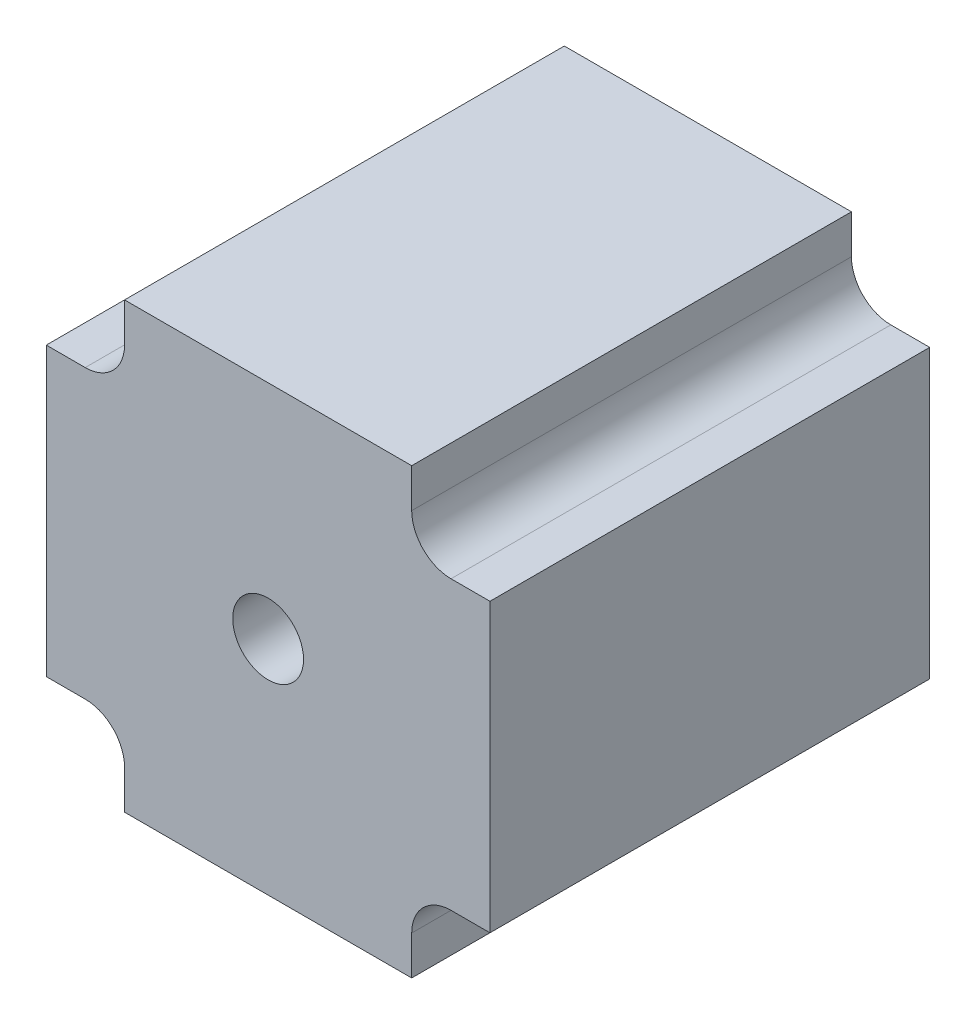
ISO-10303-21;
HEADER;
FILE_DESCRIPTION(('STEP AP214'),'2;1');
FILE_NAME('part.step','',(''),(''),'','','');
FILE_SCHEMA(('AUTOMOTIVE_DESIGN { 1 0 10303 214 1 1 1 1 }'));
ENDSEC;
DATA;
#1=APPLICATION_CONTEXT('core data for automotive mechanical design processes');
#2=APPLICATION_PROTOCOL_DEFINITION('international standard','automotive_design',2000,#1);
#3=PRODUCT_CONTEXT('',#1,'mechanical');
#4=PRODUCT('Part','Part','',(#3));
#5=PRODUCT_RELATED_PRODUCT_CATEGORY('part','',(#4));
#6=PRODUCT_DEFINITION_FORMATION('','',#4);
#7=PRODUCT_DEFINITION_CONTEXT('part definition',#1,'design');
#8=PRODUCT_DEFINITION('design','',#6,#7);
#9=PRODUCT_DEFINITION_SHAPE('','',#8);
#10=(LENGTH_UNIT() NAMED_UNIT(*) SI_UNIT(.MILLI.,.METRE.));
#11=(NAMED_UNIT(*) PLANE_ANGLE_UNIT() SI_UNIT($,.RADIAN.));
#12=(NAMED_UNIT(*) SI_UNIT($,.STERADIAN.) SOLID_ANGLE_UNIT());
#13=UNCERTAINTY_MEASURE_WITH_UNIT(LENGTH_MEASURE(1.E-05),#10,'distance_accuracy_value','');
#14=(GEOMETRIC_REPRESENTATION_CONTEXT(3) GLOBAL_UNCERTAINTY_ASSIGNED_CONTEXT((#13)) GLOBAL_UNIT_ASSIGNED_CONTEXT((#10,
#11,#12)) REPRESENTATION_CONTEXT('',''));
#15=CARTESIAN_POINT('',(0.,0.,0.));
#16=DIRECTION('',(0.,0.,1.));
#17=DIRECTION('',(1.,0.,0.));
#18=AXIS2_PLACEMENT_3D('',#15,#16,#17);
#19=CARTESIAN_POINT('',(-18.25,18.25,55.9));
#20=DIRECTION('',(0.,-1.,0.));
#21=DIRECTION('',(1.,0.,0.));
#22=AXIS2_PLACEMENT_3D('',#19,#20,#21);
#23=PLANE('',#22);
#24=DIRECTION('',(-1.,0.,0.));
#25=VECTOR('',#24,1.);
#26=CARTESIAN_POINT('',(-18.25,18.25,55.9));
#27=LINE('',#26,#25);
#28=CARTESIAN_POINT('',(-23.25,18.25,55.9));
#29=VERTEX_POINT('',#28);
#30=CARTESIAN_POINT('',(-28.2,18.25,55.9));
#31=VERTEX_POINT('',#30);
#32=EDGE_CURVE('E145',#29,#31,#27,.T.);
#33=ORIENTED_EDGE('',*,*,#32,.F.);
#34=DIRECTION('',(0.,0.,-1.));
#35=VECTOR('',#34,1.);
#36=CARTESIAN_POINT('',(-23.25,18.25,0.));
#37=LINE('',#36,#35);
#38=CARTESIAN_POINT('',(-23.25,18.25,0.));
#39=VERTEX_POINT('',#38);
#40=EDGE_CURVE('E189',#29,#39,#37,.T.);
#41=ORIENTED_EDGE('',*,*,#40,.T.);
#42=DIRECTION('',(-1.,0.,0.));
#43=VECTOR('',#42,1.);
#44=CARTESIAN_POINT('',(-18.25,18.25,0.));
#45=LINE('',#44,#43);
#46=CARTESIAN_POINT('',(-28.2,18.25,0.));
#47=VERTEX_POINT('',#46);
#48=EDGE_CURVE('E167',#39,#47,#45,.T.);
#49=ORIENTED_EDGE('',*,*,#48,.T.);
#50=DIRECTION('',(0.,0.,-1.));
#51=VECTOR('',#50,1.);
#52=CARTESIAN_POINT('',(-28.2,18.25,55.9));
#53=LINE('',#52,#51);
#54=EDGE_CURVE('E161',#31,#47,#53,.T.);
#55=ORIENTED_EDGE('',*,*,#54,.F.);
#56=EDGE_LOOP('',(#33,#41,#49,#55));
#57=FACE_BOUND('',#56,.T.);
#58=ADVANCED_FACE('F33',(#57),#23,.F.);
#59=CARTESIAN_POINT('',(-28.2,-18.25,55.9));
#60=DIRECTION('',(1.,0.,0.));
#61=DIRECTION('',(0.,0.,-1.));
#62=AXIS2_PLACEMENT_3D('',#59,#60,#61);
#63=PLANE('',#62);
#64=DIRECTION('',(0.,-1.,0.));
#65=VECTOR('',#64,1.);
#66=CARTESIAN_POINT('',(-28.2,-18.25,0.));
#67=LINE('',#66,#65);
#68=CARTESIAN_POINT('',(-28.2,-18.25,0.));
#69=VERTEX_POINT('',#68);
#70=EDGE_CURVE('E296',#47,#69,#67,.T.);
#71=ORIENTED_EDGE('',*,*,#70,.T.);
#72=DIRECTION('',(0.,0.,-1.));
#73=VECTOR('',#72,1.);
#74=CARTESIAN_POINT('',(-28.2,-18.25,55.9));
#75=LINE('',#74,#73);
#76=CARTESIAN_POINT('',(-28.2,-18.25,55.9));
#77=VERTEX_POINT('',#76);
#78=EDGE_CURVE('E163',#77,#69,#75,.T.);
#79=ORIENTED_EDGE('',*,*,#78,.F.);
#80=DIRECTION('',(0.,-1.,0.));
#81=VECTOR('',#80,1.);
#82=CARTESIAN_POINT('',(-28.2,-18.25,55.9));
#83=LINE('',#82,#81);
#84=EDGE_CURVE('E149',#31,#77,#83,.T.);
#85=ORIENTED_EDGE('',*,*,#84,.F.);
#86=ORIENTED_EDGE('',*,*,#54,.T.);
#87=EDGE_LOOP('',(#71,#79,#85,#86));
#88=FACE_BOUND('',#87,.T.);
#89=ADVANCED_FACE('F160',(#88),#63,.F.);
#90=CARTESIAN_POINT('',(-18.25,-18.25,55.9));
#91=DIRECTION('',(0.,1.,0.));
#92=DIRECTION('',(0.,0.,1.));
#93=AXIS2_PLACEMENT_3D('',#90,#91,#92);
#94=PLANE('',#93);
#95=DIRECTION('',(1.,0.,0.));
#96=VECTOR('',#95,1.);
#97=CARTESIAN_POINT('',(-18.25,-18.25,0.));
#98=LINE('',#97,#96);
#99=CARTESIAN_POINT('',(-23.25,-18.25,0.));
#100=VERTEX_POINT('',#99);
#101=EDGE_CURVE('E273',#69,#100,#98,.T.);
#102=ORIENTED_EDGE('',*,*,#101,.T.);
#103=DIRECTION('',(0.,0.,-1.));
#104=VECTOR('',#103,1.);
#105=CARTESIAN_POINT('',(-23.25,-18.25,55.9));
#106=LINE('',#105,#104);
#107=CARTESIAN_POINT('',(-23.25,-18.25,55.9));
#108=VERTEX_POINT('',#107);
#109=EDGE_CURVE('E172',#100,#108,#106,.F.);
#110=ORIENTED_EDGE('',*,*,#109,.T.);
#111=DIRECTION('',(1.,0.,0.));
#112=VECTOR('',#111,1.);
#113=CARTESIAN_POINT('',(-18.25,-18.25,55.9));
#114=LINE('',#113,#112);
#115=EDGE_CURVE('E165',#77,#108,#114,.T.);
#116=ORIENTED_EDGE('',*,*,#115,.F.);
#117=ORIENTED_EDGE('',*,*,#78,.T.);
#118=EDGE_LOOP('',(#102,#110,#116,#117));
#119=FACE_BOUND('',#118,.T.);
#120=ADVANCED_FACE('F302',(#119),#94,.F.);
#121=CARTESIAN_POINT('',(-18.25,-28.2,55.9));
#122=DIRECTION('',(1.,0.,0.));
#123=DIRECTION('',(0.,0.,-1.));
#124=AXIS2_PLACEMENT_3D('',#121,#122,#123);
#125=PLANE('',#124);
#126=DIRECTION('',(0.,-1.,0.));
#127=VECTOR('',#126,1.);
#128=CARTESIAN_POINT('',(-18.25,-28.2,55.9));
#129=LINE('',#128,#127);
#130=CARTESIAN_POINT('',(-18.25,-23.25,55.9));
#131=VERTEX_POINT('',#130);
#132=CARTESIAN_POINT('',(-18.25,-28.2,55.9));
#133=VERTEX_POINT('',#132);
#134=EDGE_CURVE('E307',#131,#133,#129,.T.);
#135=ORIENTED_EDGE('',*,*,#134,.F.);
#136=DIRECTION('',(0.,0.,-1.));
#137=VECTOR('',#136,1.);
#138=CARTESIAN_POINT('',(-18.25,-23.25,0.));
#139=LINE('',#138,#137);
#140=CARTESIAN_POINT('',(-18.25,-23.25,0.));
#141=VERTEX_POINT('',#140);
#142=EDGE_CURVE('E169',#131,#141,#139,.T.);
#143=ORIENTED_EDGE('',*,*,#142,.T.);
#144=DIRECTION('',(0.,-1.,0.));
#145=VECTOR('',#144,1.);
#146=CARTESIAN_POINT('',(-18.25,-28.2,0.));
#147=LINE('',#146,#145);
#148=CARTESIAN_POINT('',(-18.25,-28.2,0.));
#149=VERTEX_POINT('',#148);
#150=EDGE_CURVE('E268',#141,#149,#147,.T.);
#151=ORIENTED_EDGE('',*,*,#150,.T.);
#152=DIRECTION('',(0.,0.,-1.));
#153=VECTOR('',#152,1.);
#154=CARTESIAN_POINT('',(-18.25,-28.2,55.9));
#155=LINE('',#154,#153);
#156=EDGE_CURVE('E174',#133,#149,#155,.T.);
#157=ORIENTED_EDGE('',*,*,#156,.F.);
#158=EDGE_LOOP('',(#135,#143,#151,#157));
#159=FACE_BOUND('',#158,.T.);
#160=ADVANCED_FACE('F308',(#159),#125,.F.);
#161=CARTESIAN_POINT('',(18.25,-28.2,55.9));
#162=DIRECTION('',(0.,1.,0.));
#163=DIRECTION('',(0.,0.,1.));
#164=AXIS2_PLACEMENT_3D('',#161,#162,#163);
#165=PLANE('',#164);
#166=DIRECTION('',(1.,0.,0.));
#167=VECTOR('',#166,1.);
#168=CARTESIAN_POINT('',(18.25,-28.2,0.));
#169=LINE('',#168,#167);
#170=CARTESIAN_POINT('',(18.25,-28.2,0.));
#171=VERTEX_POINT('',#170);
#172=EDGE_CURVE('E262',#149,#171,#169,.T.);
#173=ORIENTED_EDGE('',*,*,#172,.T.);
#174=DIRECTION('',(0.,0.,-1.));
#175=VECTOR('',#174,1.);
#176=CARTESIAN_POINT('',(18.25,-28.2,55.9));
#177=LINE('',#176,#175);
#178=CARTESIAN_POINT('',(18.25,-28.2,55.9));
#179=VERTEX_POINT('',#178);
#180=EDGE_CURVE('E253',#179,#171,#177,.T.);
#181=ORIENTED_EDGE('',*,*,#180,.F.);
#182=DIRECTION('',(1.,0.,0.));
#183=VECTOR('',#182,1.);
#184=CARTESIAN_POINT('',(18.25,-28.2,55.9));
#185=LINE('',#184,#183);
#186=EDGE_CURVE('E263',#133,#179,#185,.T.);
#187=ORIENTED_EDGE('',*,*,#186,.F.);
#188=ORIENTED_EDGE('',*,*,#156,.T.);
#189=EDGE_LOOP('',(#173,#181,#187,#188));
#190=FACE_BOUND('',#189,.T.);
#191=ADVANCED_FACE('F260',(#190),#165,.F.);
#192=CARTESIAN_POINT('',(18.25,-28.2,55.9));
#193=DIRECTION('',(-1.,0.,0.));
#194=DIRECTION('',(0.,-1.,0.));
#195=AXIS2_PLACEMENT_3D('',#192,#193,#194);
#196=PLANE('',#195);
#197=DIRECTION('',(0.,1.,0.));
#198=VECTOR('',#197,1.);
#199=CARTESIAN_POINT('',(18.25,-28.2,0.));
#200=LINE('',#199,#198);
#201=CARTESIAN_POINT('',(18.25,-23.25,0.));
#202=VERTEX_POINT('',#201);
#203=EDGE_CURVE('E270',#171,#202,#200,.T.);
#204=ORIENTED_EDGE('',*,*,#203,.T.);
#205=DIRECTION('',(0.,0.,-1.));
#206=VECTOR('',#205,1.);
#207=CARTESIAN_POINT('',(18.25,-23.25,55.9));
#208=LINE('',#207,#206);
#209=CARTESIAN_POINT('',(18.25,-23.25,55.9));
#210=VERTEX_POINT('',#209);
#211=EDGE_CURVE('E182',#202,#210,#208,.F.);
#212=ORIENTED_EDGE('',*,*,#211,.T.);
#213=DIRECTION('',(0.,1.,0.));
#214=VECTOR('',#213,1.);
#215=CARTESIAN_POINT('',(18.25,-28.2,55.9));
#216=LINE('',#215,#214);
#217=EDGE_CURVE('E289',#179,#210,#216,.T.);
#218=ORIENTED_EDGE('',*,*,#217,.F.);
#219=ORIENTED_EDGE('',*,*,#180,.T.);
#220=EDGE_LOOP('',(#204,#212,#218,#219));
#221=FACE_BOUND('',#220,.T.);
#222=ADVANCED_FACE('F319',(#221),#196,.F.);
#223=CARTESIAN_POINT('',(28.2,-18.25,55.9));
#224=DIRECTION('',(0.,1.,0.));
#225=DIRECTION('',(-1.,0.,0.));
#226=AXIS2_PLACEMENT_3D('',#223,#224,#225);
#227=PLANE('',#226);
#228=DIRECTION('',(1.,0.,0.));
#229=VECTOR('',#228,1.);
#230=CARTESIAN_POINT('',(28.2,-18.25,55.9));
#231=LINE('',#230,#229);
#232=CARTESIAN_POINT('',(23.25,-18.25,55.9));
#233=VERTEX_POINT('',#232);
#234=CARTESIAN_POINT('',(28.2,-18.25,55.9));
#235=VERTEX_POINT('',#234);
#236=EDGE_CURVE('E286',#233,#235,#231,.T.);
#237=ORIENTED_EDGE('',*,*,#236,.F.);
#238=DIRECTION('',(0.,0.,-1.));
#239=VECTOR('',#238,1.);
#240=CARTESIAN_POINT('',(23.25,-18.25,0.));
#241=LINE('',#240,#239);
#242=CARTESIAN_POINT('',(23.25,-18.25,0.));
#243=VERTEX_POINT('',#242);
#244=EDGE_CURVE('E179',#233,#243,#241,.T.);
#245=ORIENTED_EDGE('',*,*,#244,.T.);
#246=DIRECTION('',(1.,0.,0.));
#247=VECTOR('',#246,1.);
#248=CARTESIAN_POINT('',(28.2,-18.25,0.));
#249=LINE('',#248,#247);
#250=CARTESIAN_POINT('',(28.2,-18.25,0.));
#251=VERTEX_POINT('',#250);
#252=EDGE_CURVE('E238',#243,#251,#249,.T.);
#253=ORIENTED_EDGE('',*,*,#252,.T.);
#254=DIRECTION('',(0.,0.,-1.));
#255=VECTOR('',#254,1.);
#256=CARTESIAN_POINT('',(28.2,-18.25,55.9));
#257=LINE('',#256,#255);
#258=EDGE_CURVE('E250',#235,#251,#257,.T.);
#259=ORIENTED_EDGE('',*,*,#258,.F.);
#260=EDGE_LOOP('',(#237,#245,#253,#259));
#261=FACE_BOUND('',#260,.T.);
#262=ADVANCED_FACE('F280',(#261),#227,.F.);
#263=CARTESIAN_POINT('',(28.2,-18.25,55.9));
#264=DIRECTION('',(-1.,0.,0.));
#265=DIRECTION('',(0.,0.,1.));
#266=AXIS2_PLACEMENT_3D('',#263,#264,#265);
#267=PLANE('',#266);
#268=DIRECTION('',(0.,1.,0.));
#269=VECTOR('',#268,1.);
#270=CARTESIAN_POINT('',(28.2,-18.25,0.));
#271=LINE('',#270,#269);
#272=CARTESIAN_POINT('',(28.2,18.25,0.));
#273=VERTEX_POINT('',#272);
#274=EDGE_CURVE('E234',#251,#273,#271,.T.);
#275=ORIENTED_EDGE('',*,*,#274,.T.);
#276=DIRECTION('',(0.,0.,-1.));
#277=VECTOR('',#276,1.);
#278=CARTESIAN_POINT('',(28.2,18.25,55.9));
#279=LINE('',#278,#277);
#280=CARTESIAN_POINT('',(28.2,18.25,55.9));
#281=VERTEX_POINT('',#280);
#282=EDGE_CURVE('E233',#281,#273,#279,.T.);
#283=ORIENTED_EDGE('',*,*,#282,.F.);
#284=DIRECTION('',(0.,1.,0.));
#285=VECTOR('',#284,1.);
#286=CARTESIAN_POINT('',(28.2,-18.25,55.9));
#287=LINE('',#286,#285);
#288=EDGE_CURVE('E285',#235,#281,#287,.T.);
#289=ORIENTED_EDGE('',*,*,#288,.F.);
#290=ORIENTED_EDGE('',*,*,#258,.T.);
#291=EDGE_LOOP('',(#275,#283,#289,#290));
#292=FACE_BOUND('',#291,.T.);
#293=ADVANCED_FACE('F284',(#292),#267,.F.);
#294=CARTESIAN_POINT('',(28.2,18.25,55.9));
#295=DIRECTION('',(0.,-1.,0.));
#296=DIRECTION('',(0.,0.,-1.));
#297=AXIS2_PLACEMENT_3D('',#294,#295,#296);
#298=PLANE('',#297);
#299=DIRECTION('',(-1.,0.,0.));
#300=VECTOR('',#299,1.);
#301=CARTESIAN_POINT('',(28.2,18.25,0.));
#302=LINE('',#301,#300);
#303=CARTESIAN_POINT('',(23.25,18.25,0.));
#304=VERTEX_POINT('',#303);
#305=EDGE_CURVE('E226',#273,#304,#302,.T.);
#306=ORIENTED_EDGE('',*,*,#305,.T.);
#307=DIRECTION('',(0.,0.,-1.));
#308=VECTOR('',#307,1.);
#309=CARTESIAN_POINT('',(23.25,18.25,55.9));
#310=LINE('',#309,#308);
#311=CARTESIAN_POINT('',(23.25,18.25,55.9));
#312=VERTEX_POINT('',#311);
#313=EDGE_CURVE('E187',#304,#312,#310,.F.);
#314=ORIENTED_EDGE('',*,*,#313,.T.);
#315=DIRECTION('',(-1.,0.,0.));
#316=VECTOR('',#315,1.);
#317=CARTESIAN_POINT('',(28.2,18.25,55.9));
#318=LINE('',#317,#316);
#319=EDGE_CURVE('E209',#281,#312,#318,.T.);
#320=ORIENTED_EDGE('',*,*,#319,.F.);
#321=ORIENTED_EDGE('',*,*,#282,.T.);
#322=EDGE_LOOP('',(#306,#314,#320,#321));
#323=FACE_BOUND('',#322,.T.);
#324=ADVANCED_FACE('F231',(#323),#298,.F.);
#325=CARTESIAN_POINT('',(18.25,18.25,55.9));
#326=DIRECTION('',(-1.,0.,0.));
#327=DIRECTION('',(0.,-1.,0.));
#328=AXIS2_PLACEMENT_3D('',#325,#326,#327);
#329=PLANE('',#328);
#330=DIRECTION('',(0.,1.,0.));
#331=VECTOR('',#330,1.);
#332=CARTESIAN_POINT('',(18.25,18.25,55.9));
#333=LINE('',#332,#331);
#334=CARTESIAN_POINT('',(18.25,23.25,55.9));
#335=VERTEX_POINT('',#334);
#336=CARTESIAN_POINT('',(18.25,28.2,55.9));
#337=VERTEX_POINT('',#336);
#338=EDGE_CURVE('E206',#335,#337,#333,.T.);
#339=ORIENTED_EDGE('',*,*,#338,.F.);
#340=DIRECTION('',(0.,0.,-1.));
#341=VECTOR('',#340,1.);
#342=CARTESIAN_POINT('',(18.25,23.25,0.));
#343=LINE('',#342,#341);
#344=CARTESIAN_POINT('',(18.25,23.25,0.));
#345=VERTEX_POINT('',#344);
#346=EDGE_CURVE('E184',#335,#345,#343,.T.);
#347=ORIENTED_EDGE('',*,*,#346,.T.);
#348=DIRECTION('',(0.,1.,0.));
#349=VECTOR('',#348,1.);
#350=CARTESIAN_POINT('',(18.25,18.25,0.));
#351=LINE('',#350,#349);
#352=CARTESIAN_POINT('',(18.25,28.2,0.));
#353=VERTEX_POINT('',#352);
#354=EDGE_CURVE('E228',#345,#353,#351,.T.);
#355=ORIENTED_EDGE('',*,*,#354,.T.);
#356=DIRECTION('',(0.,0.,-1.));
#357=VECTOR('',#356,1.);
#358=CARTESIAN_POINT('',(18.25,28.2,55.9));
#359=LINE('',#358,#357);
#360=EDGE_CURVE('E217',#337,#353,#359,.T.);
#361=ORIENTED_EDGE('',*,*,#360,.F.);
#362=EDGE_LOOP('',(#339,#347,#355,#361));
#363=FACE_BOUND('',#362,.T.);
#364=ADVANCED_FACE('F214',(#363),#329,.F.);
#365=CARTESIAN_POINT('',(18.25,28.2,55.9));
#366=DIRECTION('',(0.,-1.,0.));
#367=DIRECTION('',(0.,0.,-1.));
#368=AXIS2_PLACEMENT_3D('',#365,#366,#367);
#369=PLANE('',#368);
#370=DIRECTION('',(-1.,0.,0.));
#371=VECTOR('',#370,1.);
#372=CARTESIAN_POINT('',(18.25,28.2,0.));
#373=LINE('',#372,#371);
#374=CARTESIAN_POINT('',(-18.25,28.2,0.));
#375=VERTEX_POINT('',#374);
#376=EDGE_CURVE('E236',#353,#375,#373,.T.);
#377=ORIENTED_EDGE('',*,*,#376,.T.);
#378=DIRECTION('',(0.,0.,-1.));
#379=VECTOR('',#378,1.);
#380=CARTESIAN_POINT('',(-18.25,28.2,55.9));
#381=LINE('',#380,#379);
#382=CARTESIAN_POINT('',(-18.25,28.2,55.9));
#383=VERTEX_POINT('',#382);
#384=EDGE_CURVE('E244',#383,#375,#381,.T.);
#385=ORIENTED_EDGE('',*,*,#384,.F.);
#386=DIRECTION('',(-1.,0.,0.));
#387=VECTOR('',#386,1.);
#388=CARTESIAN_POINT('',(18.25,28.2,55.9));
#389=LINE('',#388,#387);
#390=EDGE_CURVE('E219',#337,#383,#389,.T.);
#391=ORIENTED_EDGE('',*,*,#390,.F.);
#392=ORIENTED_EDGE('',*,*,#360,.T.);
#393=EDGE_LOOP('',(#377,#385,#391,#392));
#394=FACE_BOUND('',#393,.T.);
#395=ADVANCED_FACE('F393',(#394),#369,.F.);
#396=CARTESIAN_POINT('',(-18.25,18.25,55.9));
#397=DIRECTION('',(1.,0.,0.));
#398=DIRECTION('',(0.,1.,0.));
#399=AXIS2_PLACEMENT_3D('',#396,#397,#398);
#400=PLANE('',#399);
#401=DIRECTION('',(0.,-1.,0.));
#402=VECTOR('',#401,1.);
#403=CARTESIAN_POINT('',(-18.25,18.25,0.));
#404=LINE('',#403,#402);
#405=CARTESIAN_POINT('',(-18.25,23.25,0.));
#406=VERTEX_POINT('',#405);
#407=EDGE_CURVE('E156',#375,#406,#404,.T.);
#408=ORIENTED_EDGE('',*,*,#407,.T.);
#409=DIRECTION('',(0.,0.,-1.));
#410=VECTOR('',#409,1.);
#411=CARTESIAN_POINT('',(-18.25,23.25,55.9));
#412=LINE('',#411,#410);
#413=CARTESIAN_POINT('',(-18.25,23.25,55.9));
#414=VERTEX_POINT('',#413);
#415=EDGE_CURVE('E48',#406,#414,#412,.F.);
#416=ORIENTED_EDGE('',*,*,#415,.T.);
#417=DIRECTION('',(0.,-1.,0.));
#418=VECTOR('',#417,1.);
#419=CARTESIAN_POINT('',(-18.25,18.25,55.9));
#420=LINE('',#419,#418);
#421=EDGE_CURVE('E247',#383,#414,#420,.T.);
#422=ORIENTED_EDGE('',*,*,#421,.F.);
#423=ORIENTED_EDGE('',*,*,#384,.T.);
#424=EDGE_LOOP('',(#408,#416,#422,#423));
#425=FACE_BOUND('',#424,.T.);
#426=ADVANCED_FACE('F383',(#425),#400,.F.);
#427=CARTESIAN_POINT('',(0.,0.,55.9));
#428=DIRECTION('',(0.,0.,-1.));
#429=DIRECTION('',(-1.,0.,0.));
#430=AXIS2_PLACEMENT_3D('',#427,#428,#429);
#431=PLANE('',#430);
#432=CARTESIAN_POINT('',(0.,0.,55.9));
#433=DIRECTION('',(0.,0.,1.));
#434=DIRECTION('',(1.,0.,0.));
#435=AXIS2_PLACEMENT_3D('',#432,#433,#434);
#436=CIRCLE('',#435,4.5);
#437=CARTESIAN_POINT('',(4.5,0.,55.9));
#438=VERTEX_POINT('',#437);
#439=EDGE_CURVE('E484',#438,#438,#436,.T.);
#440=ORIENTED_EDGE('',*,*,#439,.F.);
#441=EDGE_LOOP('',(#440));
#442=FACE_BOUND('',#441,.T.);
#443=ORIENTED_EDGE('',*,*,#421,.T.);
#444=CARTESIAN_POINT('',(-23.25,23.25,55.9));
#445=DIRECTION('',(0.,0.,-1.));
#446=DIRECTION('',(-1.,0.,0.));
#447=AXIS2_PLACEMENT_3D('',#444,#445,#446);
#448=CIRCLE('',#447,5.);
#449=EDGE_CURVE('E11',#414,#29,#448,.T.);
#450=ORIENTED_EDGE('',*,*,#449,.T.);
#451=ORIENTED_EDGE('',*,*,#32,.T.);
#452=ORIENTED_EDGE('',*,*,#84,.T.);
#453=ORIENTED_EDGE('',*,*,#115,.T.);
#454=CARTESIAN_POINT('',(-23.25,-23.25,55.9));
#455=DIRECTION('',(0.,0.,-1.));
#456=DIRECTION('',(-1.,0.,0.));
#457=AXIS2_PLACEMENT_3D('',#454,#455,#456);
#458=CIRCLE('',#457,5.);
#459=EDGE_CURVE('E194',#108,#131,#458,.T.);
#460=ORIENTED_EDGE('',*,*,#459,.T.);
#461=ORIENTED_EDGE('',*,*,#134,.T.);
#462=ORIENTED_EDGE('',*,*,#186,.T.);
#463=ORIENTED_EDGE('',*,*,#217,.T.);
#464=CARTESIAN_POINT('',(23.25,-23.25,55.9));
#465=DIRECTION('',(0.,0.,-1.));
#466=DIRECTION('',(-1.,0.,0.));
#467=AXIS2_PLACEMENT_3D('',#464,#465,#466);
#468=CIRCLE('',#467,5.);
#469=EDGE_CURVE('E198',#210,#233,#468,.T.);
#470=ORIENTED_EDGE('',*,*,#469,.T.);
#471=ORIENTED_EDGE('',*,*,#236,.T.);
#472=ORIENTED_EDGE('',*,*,#288,.T.);
#473=ORIENTED_EDGE('',*,*,#319,.T.);
#474=CARTESIAN_POINT('',(23.25,23.25,55.9));
#475=DIRECTION('',(0.,0.,-1.));
#476=DIRECTION('',(-1.,0.,0.));
#477=AXIS2_PLACEMENT_3D('',#474,#475,#476);
#478=CIRCLE('',#477,5.);
#479=EDGE_CURVE('E202',#312,#335,#478,.T.);
#480=ORIENTED_EDGE('',*,*,#479,.T.);
#481=ORIENTED_EDGE('',*,*,#338,.T.);
#482=ORIENTED_EDGE('',*,*,#390,.T.);
#483=EDGE_LOOP('',(#443,#450,#451,#452,#453,#460,#461,#462,#463,#470,#471,#472,#473,#480,#481,#482));
#484=FACE_BOUND('',#483,.T.);
#485=ADVANCED_FACE('F147',(#442,#484),#431,.F.);
#486=CARTESIAN_POINT('',(0.,0.,0.));
#487=DIRECTION('',(0.,0.,-1.));
#488=DIRECTION('',(-1.,0.,0.));
#489=AXIS2_PLACEMENT_3D('',#486,#487,#488);
#490=PLANE('',#489);
#491=CARTESIAN_POINT('',(0.,0.,0.));
#492=DIRECTION('',(0.,0.,1.));
#493=DIRECTION('',(1.,0.,0.));
#494=AXIS2_PLACEMENT_3D('',#491,#492,#493);
#495=CIRCLE('',#494,4.5);
#496=CARTESIAN_POINT('',(4.5,0.,0.));
#497=VERTEX_POINT('',#496);
#498=EDGE_CURVE('E297',#497,#497,#495,.T.);
#499=ORIENTED_EDGE('',*,*,#498,.T.);
#500=EDGE_LOOP('',(#499));
#501=FACE_BOUND('',#500,.T.);
#502=ORIENTED_EDGE('',*,*,#48,.F.);
#503=CARTESIAN_POINT('',(-23.25,23.25,0.));
#504=DIRECTION('',(0.,0.,-1.));
#505=DIRECTION('',(-1.,0.,0.));
#506=AXIS2_PLACEMENT_3D('',#503,#504,#505);
#507=CIRCLE('',#506,5.);
#508=EDGE_CURVE('E41',#39,#406,#507,.F.);
#509=ORIENTED_EDGE('',*,*,#508,.T.);
#510=ORIENTED_EDGE('',*,*,#407,.F.);
#511=ORIENTED_EDGE('',*,*,#376,.F.);
#512=ORIENTED_EDGE('',*,*,#354,.F.);
#513=CARTESIAN_POINT('',(23.25,23.25,0.));
#514=DIRECTION('',(0.,0.,-1.));
#515=DIRECTION('',(-1.,0.,0.));
#516=AXIS2_PLACEMENT_3D('',#513,#514,#515);
#517=CIRCLE('',#516,5.);
#518=EDGE_CURVE('E200',#345,#304,#517,.F.);
#519=ORIENTED_EDGE('',*,*,#518,.T.);
#520=ORIENTED_EDGE('',*,*,#305,.F.);
#521=ORIENTED_EDGE('',*,*,#274,.F.);
#522=ORIENTED_EDGE('',*,*,#252,.F.);
#523=CARTESIAN_POINT('',(23.25,-23.25,0.));
#524=DIRECTION('',(0.,0.,-1.));
#525=DIRECTION('',(-1.,0.,0.));
#526=AXIS2_PLACEMENT_3D('',#523,#524,#525);
#527=CIRCLE('',#526,5.);
#528=EDGE_CURVE('E196',#243,#202,#527,.F.);
#529=ORIENTED_EDGE('',*,*,#528,.T.);
#530=ORIENTED_EDGE('',*,*,#203,.F.);
#531=ORIENTED_EDGE('',*,*,#172,.F.);
#532=ORIENTED_EDGE('',*,*,#150,.F.);
#533=CARTESIAN_POINT('',(-23.25,-23.25,0.));
#534=DIRECTION('',(0.,0.,-1.));
#535=DIRECTION('',(-1.,0.,0.));
#536=AXIS2_PLACEMENT_3D('',#533,#534,#535);
#537=CIRCLE('',#536,5.);
#538=EDGE_CURVE('E192',#141,#100,#537,.F.);
#539=ORIENTED_EDGE('',*,*,#538,.T.);
#540=ORIENTED_EDGE('',*,*,#101,.F.);
#541=ORIENTED_EDGE('',*,*,#70,.F.);
#542=EDGE_LOOP('',(#502,#509,#510,#511,#512,#519,#520,#521,#522,#529,#530,#531,#532,#539,#540,#541));
#543=FACE_BOUND('',#542,.T.);
#544=ADVANCED_FACE('F224',(#501,#543),#490,.T.);
#545=CARTESIAN_POINT('',(0.,0.,0.));
#546=DIRECTION('',(0.,0.,1.));
#547=DIRECTION('',(1.,0.,0.));
#548=AXIS2_PLACEMENT_3D('',#545,#546,#547);
#549=CYLINDRICAL_SURFACE('',#548,4.5);
#550=ORIENTED_EDGE('',*,*,#498,.F.);
#551=EDGE_LOOP('',(#550));
#552=FACE_BOUND('',#551,.T.);
#553=ORIENTED_EDGE('',*,*,#439,.T.);
#554=EDGE_LOOP('',(#553));
#555=FACE_BOUND('',#554,.T.);
#556=ADVANCED_FACE('F338',(#552,#555),#549,.F.);
#557=CARTESIAN_POINT('',(-23.25,-23.25,55.9));
#558=DIRECTION('',(0.,0.,1.));
#559=DIRECTION('',(1.,0.,0.));
#560=AXIS2_PLACEMENT_3D('',#557,#558,#559);
#561=CYLINDRICAL_SURFACE('',#560,5.);
#562=ORIENTED_EDGE('',*,*,#459,.F.);
#563=ORIENTED_EDGE('',*,*,#109,.F.);
#564=ORIENTED_EDGE('',*,*,#538,.F.);
#565=ORIENTED_EDGE('',*,*,#142,.F.);
#566=EDGE_LOOP('',(#562,#563,#564,#565));
#567=FACE_BOUND('',#566,.T.);
#568=ADVANCED_FACE('F305',(#567),#561,.F.);
#569=CARTESIAN_POINT('',(23.25,-23.25,55.9));
#570=DIRECTION('',(0.,0.,1.));
#571=DIRECTION('',(1.,0.,0.));
#572=AXIS2_PLACEMENT_3D('',#569,#570,#571);
#573=CYLINDRICAL_SURFACE('',#572,5.);
#574=ORIENTED_EDGE('',*,*,#469,.F.);
#575=ORIENTED_EDGE('',*,*,#211,.F.);
#576=ORIENTED_EDGE('',*,*,#528,.F.);
#577=ORIENTED_EDGE('',*,*,#244,.F.);
#578=EDGE_LOOP('',(#574,#575,#576,#577));
#579=FACE_BOUND('',#578,.T.);
#580=ADVANCED_FACE('F318',(#579),#573,.F.);
#581=CARTESIAN_POINT('',(23.25,23.25,55.9));
#582=DIRECTION('',(0.,0.,1.));
#583=DIRECTION('',(1.,0.,0.));
#584=AXIS2_PLACEMENT_3D('',#581,#582,#583);
#585=CYLINDRICAL_SURFACE('',#584,5.);
#586=ORIENTED_EDGE('',*,*,#479,.F.);
#587=ORIENTED_EDGE('',*,*,#313,.F.);
#588=ORIENTED_EDGE('',*,*,#518,.F.);
#589=ORIENTED_EDGE('',*,*,#346,.F.);
#590=EDGE_LOOP('',(#586,#587,#588,#589));
#591=FACE_BOUND('',#590,.T.);
#592=ADVANCED_FACE('F221',(#591),#585,.F.);
#593=CARTESIAN_POINT('',(-23.25,23.25,55.9));
#594=DIRECTION('',(0.,0.,1.));
#595=DIRECTION('',(1.,0.,0.));
#596=AXIS2_PLACEMENT_3D('',#593,#594,#595);
#597=CYLINDRICAL_SURFACE('',#596,5.);
#598=ORIENTED_EDGE('',*,*,#449,.F.);
#599=ORIENTED_EDGE('',*,*,#415,.F.);
#600=ORIENTED_EDGE('',*,*,#508,.F.);
#601=ORIENTED_EDGE('',*,*,#40,.F.);
#602=EDGE_LOOP('',(#598,#599,#600,#601));
#603=FACE_BOUND('',#602,.T.);
#604=ADVANCED_FACE('F35',(#603),#597,.F.);
#605=CLOSED_SHELL('',(#58,#89,#120,#160,#191,#222,#262,#293,#324,#364,#395,#426,#485,#544,#556,
#568,#580,#592,#604));
#606=MANIFOLD_SOLID_BREP('B2',#605);
#607=ADVANCED_BREP_SHAPE_REPRESENTATION('',(#18,#606),#14);
#608=SHAPE_DEFINITION_REPRESENTATION(#9,#607);
ENDSEC;
END-ISO-10303-21;
